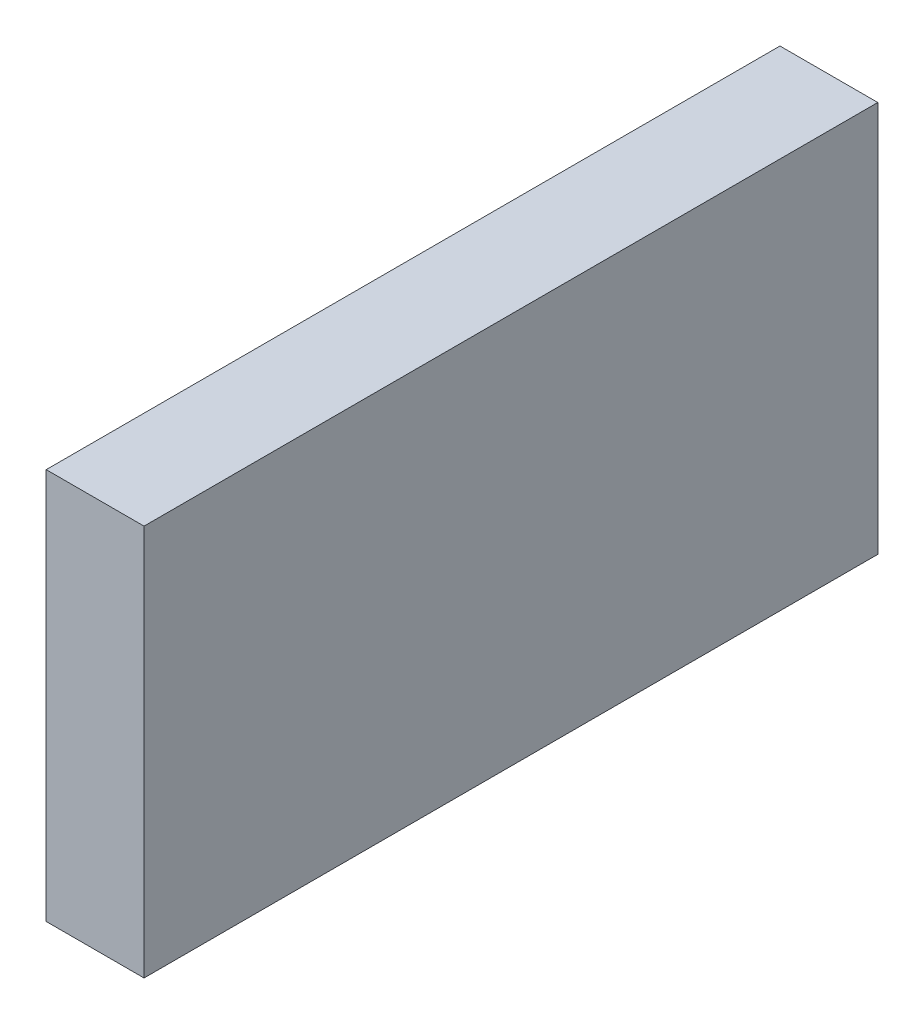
ISO-10303-21;
HEADER;
FILE_DESCRIPTION(('STEP AP214'),'2;1');
FILE_NAME('part.step','',(''),(''),'','','');
FILE_SCHEMA(('AUTOMOTIVE_DESIGN { 1 0 10303 214 1 1 1 1 }'));
ENDSEC;
DATA;
#1=APPLICATION_CONTEXT('core data for automotive mechanical design processes');
#2=APPLICATION_PROTOCOL_DEFINITION('international standard','automotive_design',2000,#1);
#3=PRODUCT_CONTEXT('',#1,'mechanical');
#4=PRODUCT('Part','Part','',(#3));
#5=PRODUCT_RELATED_PRODUCT_CATEGORY('part','',(#4));
#6=PRODUCT_DEFINITION_FORMATION('','',#4);
#7=PRODUCT_DEFINITION_CONTEXT('part definition',#1,'design');
#8=PRODUCT_DEFINITION('design','',#6,#7);
#9=PRODUCT_DEFINITION_SHAPE('','',#8);
#10=(LENGTH_UNIT() NAMED_UNIT(*) SI_UNIT(.MILLI.,.METRE.));
#11=(NAMED_UNIT(*) PLANE_ANGLE_UNIT() SI_UNIT($,.RADIAN.));
#12=(NAMED_UNIT(*) SI_UNIT($,.STERADIAN.) SOLID_ANGLE_UNIT());
#13=UNCERTAINTY_MEASURE_WITH_UNIT(LENGTH_MEASURE(1.E-05),#10,'distance_accuracy_value','');
#14=(GEOMETRIC_REPRESENTATION_CONTEXT(3) GLOBAL_UNCERTAINTY_ASSIGNED_CONTEXT((#13)) GLOBAL_UNIT_ASSIGNED_CONTEXT((#10,
#11,#12)) REPRESENTATION_CONTEXT('',''));
#15=CARTESIAN_POINT('',(0.,0.,0.));
#16=DIRECTION('',(0.,0.,1.));
#17=DIRECTION('',(1.,0.,0.));
#18=AXIS2_PLACEMENT_3D('',#15,#16,#17);
#19=CARTESIAN_POINT('',(2.,0.,0.));
#20=DIRECTION('',(0.,0.,-1.));
#21=DIRECTION('',(-1.,0.,0.));
#22=AXIS2_PLACEMENT_3D('',#19,#20,#21);
#23=PLANE('',#22);
#24=DIRECTION('',(0.,-1.,0.));
#25=VECTOR('',#24,1.);
#26=CARTESIAN_POINT('',(0.,0.,0.));
#27=LINE('',#26,#25);
#28=CARTESIAN_POINT('',(0.,8.,0.));
#29=VERTEX_POINT('',#28);
#30=CARTESIAN_POINT('',(0.,0.,0.));
#31=VERTEX_POINT('',#30);
#32=EDGE_CURVE('E70',#29,#31,#27,.T.);
#33=ORIENTED_EDGE('',*,*,#32,.T.);
#34=DIRECTION('',(-1.,0.,0.));
#35=VECTOR('',#34,1.);
#36=CARTESIAN_POINT('',(2.,0.,0.));
#37=LINE('',#36,#35);
#38=CARTESIAN_POINT('',(2.,0.,0.));
#39=VERTEX_POINT('',#38);
#40=EDGE_CURVE('E11',#39,#31,#37,.T.);
#41=ORIENTED_EDGE('',*,*,#40,.F.);
#42=DIRECTION('',(0.,-1.,0.));
#43=VECTOR('',#42,1.);
#44=CARTESIAN_POINT('',(2.,0.,0.));
#45=LINE('',#44,#43);
#46=CARTESIAN_POINT('',(2.,8.,0.));
#47=VERTEX_POINT('',#46);
#48=EDGE_CURVE('E88',#47,#39,#45,.T.);
#49=ORIENTED_EDGE('',*,*,#48,.F.);
#50=DIRECTION('',(-1.,0.,0.));
#51=VECTOR('',#50,1.);
#52=CARTESIAN_POINT('',(2.,8.,0.));
#53=LINE('',#52,#51);
#54=EDGE_CURVE('E82',#47,#29,#53,.T.);
#55=ORIENTED_EDGE('',*,*,#54,.T.);
#56=EDGE_LOOP('',(#33,#41,#49,#55));
#57=FACE_BOUND('',#56,.T.);
#58=ADVANCED_FACE('F26',(#57),#23,.F.);
#59=CARTESIAN_POINT('',(2.,0.,0.));
#60=DIRECTION('',(0.,1.,0.));
#61=DIRECTION('',(0.,0.,1.));
#62=AXIS2_PLACEMENT_3D('',#59,#60,#61);
#63=PLANE('',#62);
#64=DIRECTION('',(0.,0.,-1.));
#65=VECTOR('',#64,1.);
#66=CARTESIAN_POINT('',(0.,0.,0.));
#67=LINE('',#66,#65);
#68=CARTESIAN_POINT('',(0.,0.,-15.));
#69=VERTEX_POINT('',#68);
#70=EDGE_CURVE('E66',#31,#69,#67,.T.);
#71=ORIENTED_EDGE('',*,*,#70,.T.);
#72=DIRECTION('',(-1.,0.,0.));
#73=VECTOR('',#72,1.);
#74=CARTESIAN_POINT('',(2.,0.,-15.));
#75=LINE('',#74,#73);
#76=CARTESIAN_POINT('',(2.,0.,-15.));
#77=VERTEX_POINT('',#76);
#78=EDGE_CURVE('E33',#77,#69,#75,.T.);
#79=ORIENTED_EDGE('',*,*,#78,.F.);
#80=DIRECTION('',(0.,0.,-1.));
#81=VECTOR('',#80,1.);
#82=CARTESIAN_POINT('',(2.,0.,0.));
#83=LINE('',#82,#81);
#84=EDGE_CURVE('E78',#39,#77,#83,.T.);
#85=ORIENTED_EDGE('',*,*,#84,.F.);
#86=ORIENTED_EDGE('',*,*,#40,.T.);
#87=EDGE_LOOP('',(#71,#79,#85,#86));
#88=FACE_BOUND('',#87,.T.);
#89=ADVANCED_FACE('F77',(#88),#63,.F.);
#90=CARTESIAN_POINT('',(2.,0.,-15.));
#91=DIRECTION('',(0.,0.,1.));
#92=DIRECTION('',(1.,0.,0.));
#93=AXIS2_PLACEMENT_3D('',#90,#91,#92);
#94=PLANE('',#93);
#95=DIRECTION('',(0.,1.,0.));
#96=VECTOR('',#95,1.);
#97=CARTESIAN_POINT('',(0.,0.,-15.));
#98=LINE('',#97,#96);
#99=CARTESIAN_POINT('',(0.,8.,-15.));
#100=VERTEX_POINT('',#99);
#101=EDGE_CURVE('E71',#69,#100,#98,.T.);
#102=ORIENTED_EDGE('',*,*,#101,.T.);
#103=DIRECTION('',(-1.,0.,0.));
#104=VECTOR('',#103,1.);
#105=CARTESIAN_POINT('',(2.,8.,-15.));
#106=LINE('',#105,#104);
#107=CARTESIAN_POINT('',(2.,8.,-15.));
#108=VERTEX_POINT('',#107);
#109=EDGE_CURVE('E94',#108,#100,#106,.T.);
#110=ORIENTED_EDGE('',*,*,#109,.F.);
#111=DIRECTION('',(0.,1.,0.));
#112=VECTOR('',#111,1.);
#113=CARTESIAN_POINT('',(2.,0.,-15.));
#114=LINE('',#113,#112);
#115=EDGE_CURVE('E45',#77,#108,#114,.T.);
#116=ORIENTED_EDGE('',*,*,#115,.F.);
#117=ORIENTED_EDGE('',*,*,#78,.T.);
#118=EDGE_LOOP('',(#102,#110,#116,#117));
#119=FACE_BOUND('',#118,.T.);
#120=ADVANCED_FACE('F97',(#119),#94,.F.);
#121=CARTESIAN_POINT('',(2.,8.,0.));
#122=DIRECTION('',(0.,-1.,0.));
#123=DIRECTION('',(0.,0.,-1.));
#124=AXIS2_PLACEMENT_3D('',#121,#122,#123);
#125=PLANE('',#124);
#126=DIRECTION('',(0.,0.,1.));
#127=VECTOR('',#126,1.);
#128=CARTESIAN_POINT('',(0.,8.,0.));
#129=LINE('',#128,#127);
#130=EDGE_CURVE('E86',#100,#29,#129,.T.);
#131=ORIENTED_EDGE('',*,*,#130,.T.);
#132=ORIENTED_EDGE('',*,*,#54,.F.);
#133=DIRECTION('',(0.,0.,1.));
#134=VECTOR('',#133,1.);
#135=CARTESIAN_POINT('',(2.,8.,0.));
#136=LINE('',#135,#134);
#137=EDGE_CURVE('E40',#108,#47,#136,.T.);
#138=ORIENTED_EDGE('',*,*,#137,.F.);
#139=ORIENTED_EDGE('',*,*,#109,.T.);
#140=EDGE_LOOP('',(#131,#132,#138,#139));
#141=FACE_BOUND('',#140,.T.);
#142=ADVANCED_FACE('F99',(#141),#125,.F.);
#143=CARTESIAN_POINT('',(2.,8.,0.));
#144=DIRECTION('',(-1.,0.,0.));
#145=DIRECTION('',(0.,0.,1.));
#146=AXIS2_PLACEMENT_3D('',#143,#144,#145);
#147=PLANE('',#146);
#148=ORIENTED_EDGE('',*,*,#48,.T.);
#149=ORIENTED_EDGE('',*,*,#84,.T.);
#150=ORIENTED_EDGE('',*,*,#115,.T.);
#151=ORIENTED_EDGE('',*,*,#137,.T.);
#152=EDGE_LOOP('',(#148,#149,#150,#151));
#153=FACE_BOUND('',#152,.T.);
#154=ADVANCED_FACE('F100',(#153),#147,.F.);
#155=CARTESIAN_POINT('',(0.,8.,0.));
#156=DIRECTION('',(-1.,0.,0.));
#157=DIRECTION('',(0.,0.,1.));
#158=AXIS2_PLACEMENT_3D('',#155,#156,#157);
#159=PLANE('',#158);
#160=ORIENTED_EDGE('',*,*,#32,.F.);
#161=ORIENTED_EDGE('',*,*,#130,.F.);
#162=ORIENTED_EDGE('',*,*,#101,.F.);
#163=ORIENTED_EDGE('',*,*,#70,.F.);
#164=EDGE_LOOP('',(#160,#161,#162,#163));
#165=FACE_BOUND('',#164,.T.);
#166=ADVANCED_FACE('F67',(#165),#159,.T.);
#167=CLOSED_SHELL('',(#58,#89,#120,#142,#154,#166));
#168=MANIFOLD_SOLID_BREP('B2',#167);
#169=ADVANCED_BREP_SHAPE_REPRESENTATION('',(#18,#168),#14);
#170=SHAPE_DEFINITION_REPRESENTATION(#9,#169);
ENDSEC;
END-ISO-10303-21;
